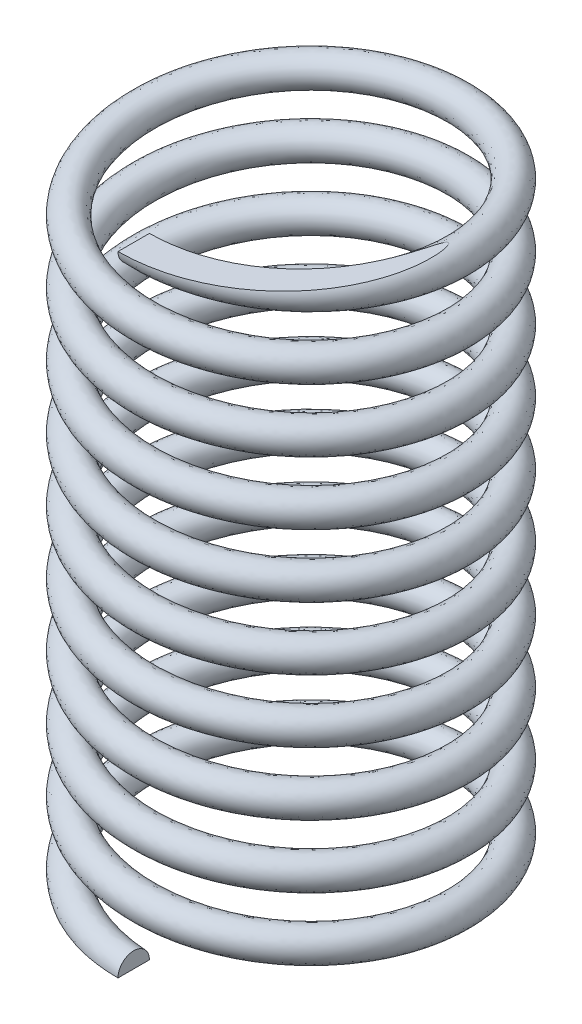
from build123d import *

# Parameters (mm, degrees)
SWEEP1_PITCH  = 10
SWEEP1_HEIGHT = 100
SWEEP1_RADIUS = 25
SKETCH2_R     = 2.5


with BuildPart() as part:
    # Sweep1: sweep along a helix
    with BuildLine() as sweep1_path:
        Helix(SWEEP1_PITCH, SWEEP1_HEIGHT, SWEEP1_RADIUS, center=(0, 0, 0), direction=(0, 1, 0), lefthand=True)
    # Sketch2 → Sweep1 (sweep)
    with BuildSketch(Plane(origin=(0, 0, 0), x_dir=(0, 0, -1), z_dir=(1, 0, 0))):
        with Locations((-25, 0)):
            Circle(SKETCH2_R)
    sweep(path=sweep1_path.line, is_frenet=True)

    # SurfaceCut1
    split(bisect_by=Plane(origin=(0, 0, 0), x_dir=(1, 0, 0), z_dir=(0, 1, 0)), keep=Keep.TOP)

    # SurfaceCut2
    split(bisect_by=Plane(origin=(0, 100, 0), x_dir=(1, 0, 0), z_dir=(0, 1, 0)), keep=Keep.BOTTOM)


solid = part.part
